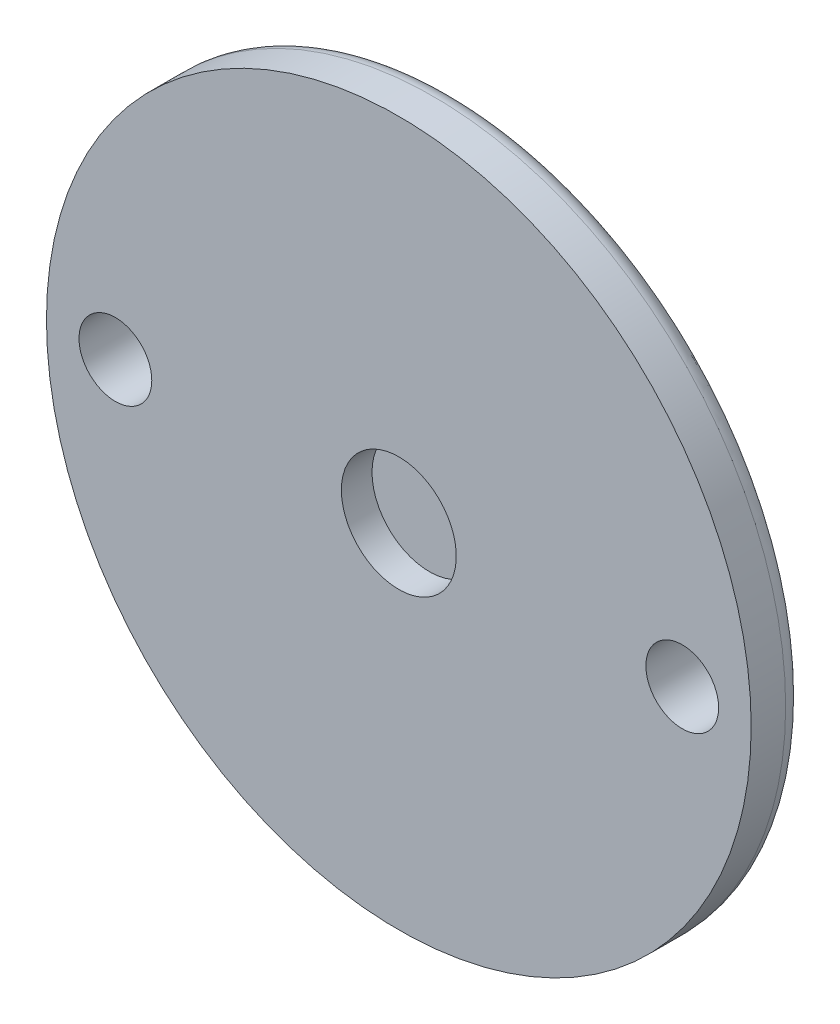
ISO-10303-21;
HEADER;
FILE_DESCRIPTION(('STEP AP214'),'2;1');
FILE_NAME('part.step','',(''),(''),'','','');
FILE_SCHEMA(('AUTOMOTIVE_DESIGN { 1 0 10303 214 1 1 1 1 }'));
ENDSEC;
DATA;
#1=APPLICATION_CONTEXT('core data for automotive mechanical design processes');
#2=APPLICATION_PROTOCOL_DEFINITION('international standard','automotive_design',2000,#1);
#3=PRODUCT_CONTEXT('',#1,'mechanical');
#4=PRODUCT('Part','Part','',(#3));
#5=PRODUCT_RELATED_PRODUCT_CATEGORY('part','',(#4));
#6=PRODUCT_DEFINITION_FORMATION('','',#4);
#7=PRODUCT_DEFINITION_CONTEXT('part definition',#1,'design');
#8=PRODUCT_DEFINITION('design','',#6,#7);
#9=PRODUCT_DEFINITION_SHAPE('','',#8);
#10=(LENGTH_UNIT() NAMED_UNIT(*) SI_UNIT(.MILLI.,.METRE.));
#11=(NAMED_UNIT(*) PLANE_ANGLE_UNIT() SI_UNIT($,.RADIAN.));
#12=(NAMED_UNIT(*) SI_UNIT($,.STERADIAN.) SOLID_ANGLE_UNIT());
#13=UNCERTAINTY_MEASURE_WITH_UNIT(LENGTH_MEASURE(1.E-05),#10,'distance_accuracy_value','');
#14=(GEOMETRIC_REPRESENTATION_CONTEXT(3) GLOBAL_UNCERTAINTY_ASSIGNED_CONTEXT((#13)) GLOBAL_UNIT_ASSIGNED_CONTEXT((#10,
#11,#12)) REPRESENTATION_CONTEXT('',''));
#15=CARTESIAN_POINT('',(0.,0.,0.));
#16=DIRECTION('',(0.,0.,1.));
#17=DIRECTION('',(1.,0.,0.));
#18=AXIS2_PLACEMENT_3D('',#15,#16,#17);
#19=CARTESIAN_POINT('',(0.,0.,2.5));
#20=DIRECTION('',(0.,0.,-1.));
#21=DIRECTION('',(-1.,0.,0.));
#22=AXIS2_PLACEMENT_3D('',#19,#20,#21);
#23=TOROIDAL_SURFACE('',#22,43.5,2.5);
#24=CARTESIAN_POINT('',(0.,0.,0.));
#25=DIRECTION('',(0.,0.,1.));
#26=DIRECTION('',(1.,0.,0.));
#27=AXIS2_PLACEMENT_3D('',#24,#25,#26);
#28=CIRCLE('',#27,43.5);
#29=CARTESIAN_POINT('',(43.5,0.,0.));
#30=VERTEX_POINT('',#29);
#31=EDGE_CURVE('E50',#30,#30,#28,.F.);
#32=ORIENTED_EDGE('',*,*,#31,.F.);
#33=EDGE_LOOP('',(#32));
#34=FACE_BOUND('',#33,.T.);
#35=CARTESIAN_POINT('',(0.,0.,2.5));
#36=DIRECTION('',(0.,0.,1.));
#37=DIRECTION('',(1.,0.,0.));
#38=AXIS2_PLACEMENT_3D('',#35,#36,#37);
#39=CIRCLE('',#38,46.);
#40=CARTESIAN_POINT('',(46.,0.,2.5));
#41=VERTEX_POINT('',#40);
#42=EDGE_CURVE('E46',#41,#41,#39,.T.);
#43=ORIENTED_EDGE('',*,*,#42,.F.);
#44=EDGE_LOOP('',(#43));
#45=FACE_BOUND('',#44,.T.);
#46=ADVANCED_FACE('F13',(#34,#45),#23,.T.);
#47=CARTESIAN_POINT('',(0.,0.,3.));
#48=DIRECTION('',(0.,0.,-1.));
#49=DIRECTION('',(-1.,0.,0.));
#50=AXIS2_PLACEMENT_3D('',#47,#48,#49);
#51=PLANE('',#50);
#52=CARTESIAN_POINT('',(0.,0.,3.));
#53=DIRECTION('',(0.,0.,-1.));
#54=DIRECTION('',(-1.,0.,0.));
#55=AXIS2_PLACEMENT_3D('',#52,#53,#54);
#56=CIRCLE('',#55,7.5);
#57=CARTESIAN_POINT('',(-7.5,0.,3.));
#58=VERTEX_POINT('',#57);
#59=EDGE_CURVE('E18',#58,#58,#56,.F.);
#60=ORIENTED_EDGE('',*,*,#59,.T.);
#61=EDGE_LOOP('',(#60));
#62=FACE_BOUND('',#61,.T.);
#63=ADVANCED_FACE('F75',(#62),#51,.F.);
#64=CARTESIAN_POINT('',(0.,0.,0.));
#65=DIRECTION('',(0.,0.,-1.));
#66=DIRECTION('',(-1.,0.,0.));
#67=AXIS2_PLACEMENT_3D('',#64,#65,#66);
#68=PLANE('',#67);
#69=CARTESIAN_POINT('',(37.,0.,0.));
#70=DIRECTION('',(0.,0.,1.));
#71=DIRECTION('',(1.,0.,0.));
#72=AXIS2_PLACEMENT_3D('',#69,#70,#71);
#73=CIRCLE('',#72,4.75);
#74=CARTESIAN_POINT('',(41.75,0.,0.));
#75=VERTEX_POINT('',#74);
#76=EDGE_CURVE('E41',#75,#75,#73,.T.);
#77=ORIENTED_EDGE('',*,*,#76,.T.);
#78=EDGE_LOOP('',(#77));
#79=FACE_BOUND('',#78,.T.);
#80=CARTESIAN_POINT('',(-37.,0.,0.));
#81=DIRECTION('',(0.,0.,1.));
#82=DIRECTION('',(1.,0.,0.));
#83=AXIS2_PLACEMENT_3D('',#80,#81,#82);
#84=CIRCLE('',#83,4.75);
#85=CARTESIAN_POINT('',(-32.25,0.,0.));
#86=VERTEX_POINT('',#85);
#87=EDGE_CURVE('E39',#86,#86,#84,.T.);
#88=ORIENTED_EDGE('',*,*,#87,.T.);
#89=EDGE_LOOP('',(#88));
#90=FACE_BOUND('',#89,.T.);
#91=ORIENTED_EDGE('',*,*,#31,.T.);
#92=EDGE_LOOP('',(#91));
#93=FACE_BOUND('',#92,.T.);
#94=ADVANCED_FACE('F65',(#79,#90,#93),#68,.T.);
#95=CARTESIAN_POINT('',(0.,0.,0.));
#96=DIRECTION('',(0.,0.,1.));
#97=DIRECTION('',(1.,0.,0.));
#98=AXIS2_PLACEMENT_3D('',#95,#96,#97);
#99=CYLINDRICAL_SURFACE('',#98,46.);
#100=ORIENTED_EDGE('',*,*,#42,.T.);
#101=EDGE_LOOP('',(#100));
#102=FACE_BOUND('',#101,.T.);
#103=CARTESIAN_POINT('',(0.,0.,7.));
#104=DIRECTION('',(0.,0.,1.));
#105=DIRECTION('',(1.,0.,0.));
#106=AXIS2_PLACEMENT_3D('',#103,#104,#105);
#107=CIRCLE('',#106,46.);
#108=CARTESIAN_POINT('',(46.,0.,7.));
#109=VERTEX_POINT('',#108);
#110=EDGE_CURVE('E36',#109,#109,#107,.F.);
#111=ORIENTED_EDGE('',*,*,#110,.T.);
#112=EDGE_LOOP('',(#111));
#113=FACE_BOUND('',#112,.T.);
#114=ADVANCED_FACE('F74',(#102,#113),#99,.T.);
#115=CARTESIAN_POINT('',(0.,0.,7.));
#116=DIRECTION('',(0.,0.,-1.));
#117=DIRECTION('',(-1.,0.,0.));
#118=AXIS2_PLACEMENT_3D('',#115,#116,#117);
#119=CYLINDRICAL_SURFACE('',#118,7.5);
#120=CARTESIAN_POINT('',(0.,0.,7.));
#121=DIRECTION('',(0.,0.,-1.));
#122=DIRECTION('',(-1.,0.,0.));
#123=AXIS2_PLACEMENT_3D('',#120,#121,#122);
#124=CIRCLE('',#123,7.5);
#125=CARTESIAN_POINT('',(-7.5,0.,7.));
#126=VERTEX_POINT('',#125);
#127=EDGE_CURVE('E27',#126,#126,#124,.F.);
#128=ORIENTED_EDGE('',*,*,#127,.T.);
#129=EDGE_LOOP('',(#128));
#130=FACE_BOUND('',#129,.T.);
#131=ORIENTED_EDGE('',*,*,#59,.F.);
#132=EDGE_LOOP('',(#131));
#133=FACE_BOUND('',#132,.T.);
#134=ADVANCED_FACE('F97',(#130,#133),#119,.F.);
#135=CARTESIAN_POINT('',(37.,0.,0.));
#136=DIRECTION('',(0.,0.,1.));
#137=DIRECTION('',(1.,0.,0.));
#138=AXIS2_PLACEMENT_3D('',#135,#136,#137);
#139=CYLINDRICAL_SURFACE('',#138,4.75);
#140=ORIENTED_EDGE('',*,*,#76,.F.);
#141=EDGE_LOOP('',(#140));
#142=FACE_BOUND('',#141,.T.);
#143=CARTESIAN_POINT('',(37.,0.,7.));
#144=DIRECTION('',(0.,0.,1.));
#145=DIRECTION('',(1.,0.,0.));
#146=AXIS2_PLACEMENT_3D('',#143,#144,#145);
#147=CIRCLE('',#146,4.75);
#148=CARTESIAN_POINT('',(41.75,0.,7.));
#149=VERTEX_POINT('',#148);
#150=EDGE_CURVE('E22',#149,#149,#147,.T.);
#151=ORIENTED_EDGE('',*,*,#150,.T.);
#152=EDGE_LOOP('',(#151));
#153=FACE_BOUND('',#152,.T.);
#154=ADVANCED_FACE('F91',(#142,#153),#139,.F.);
#155=CARTESIAN_POINT('',(-37.,0.,0.));
#156=DIRECTION('',(0.,0.,1.));
#157=DIRECTION('',(1.,0.,0.));
#158=AXIS2_PLACEMENT_3D('',#155,#156,#157);
#159=CYLINDRICAL_SURFACE('',#158,4.75);
#160=ORIENTED_EDGE('',*,*,#87,.F.);
#161=EDGE_LOOP('',(#160));
#162=FACE_BOUND('',#161,.T.);
#163=CARTESIAN_POINT('',(-37.,0.,7.));
#164=DIRECTION('',(0.,0.,1.));
#165=DIRECTION('',(1.,0.,0.));
#166=AXIS2_PLACEMENT_3D('',#163,#164,#165);
#167=CIRCLE('',#166,4.75);
#168=CARTESIAN_POINT('',(-32.25,0.,7.));
#169=VERTEX_POINT('',#168);
#170=EDGE_CURVE('E9',#169,#169,#167,.T.);
#171=ORIENTED_EDGE('',*,*,#170,.T.);
#172=EDGE_LOOP('',(#171));
#173=FACE_BOUND('',#172,.T.);
#174=ADVANCED_FACE('F85',(#162,#173),#159,.F.);
#175=CARTESIAN_POINT('',(0.,0.,7.));
#176=DIRECTION('',(0.,0.,-1.));
#177=DIRECTION('',(-1.,0.,0.));
#178=AXIS2_PLACEMENT_3D('',#175,#176,#177);
#179=PLANE('',#178);
#180=ORIENTED_EDGE('',*,*,#170,.F.);
#181=EDGE_LOOP('',(#180));
#182=FACE_BOUND('',#181,.T.);
#183=ORIENTED_EDGE('',*,*,#150,.F.);
#184=EDGE_LOOP('',(#183));
#185=FACE_BOUND('',#184,.T.);
#186=ORIENTED_EDGE('',*,*,#127,.F.);
#187=EDGE_LOOP('',(#186));
#188=FACE_BOUND('',#187,.T.);
#189=ORIENTED_EDGE('',*,*,#110,.F.);
#190=EDGE_LOOP('',(#189));
#191=FACE_BOUND('',#190,.T.);
#192=ADVANCED_FACE('F83',(#182,#185,#188,#191),#179,.F.);
#193=CLOSED_SHELL('',(#46,#63,#94,#114,#134,#154,#174,#192));
#194=MANIFOLD_SOLID_BREP('B1',#193);
#195=ADVANCED_BREP_SHAPE_REPRESENTATION('',(#18,#194),#14);
#196=SHAPE_DEFINITION_REPRESENTATION(#9,#195);
ENDSEC;
END-ISO-10303-21;
